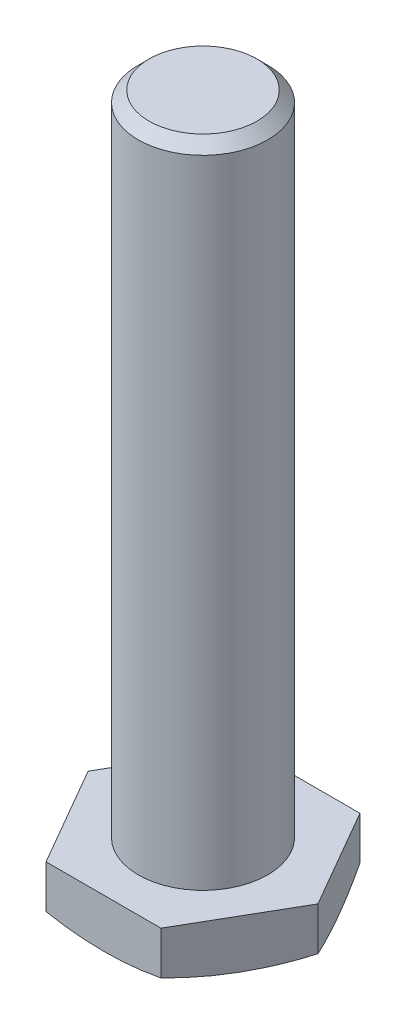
ISO-10303-21;
HEADER;
FILE_DESCRIPTION(('STEP AP214'),'2;1');
FILE_NAME('part.step','',(''),(''),'','','');
FILE_SCHEMA(('AUTOMOTIVE_DESIGN { 1 0 10303 214 1 1 1 1 }'));
ENDSEC;
DATA;
#1=APPLICATION_CONTEXT('core data for automotive mechanical design processes');
#2=APPLICATION_PROTOCOL_DEFINITION('international standard','automotive_design',2000,#1);
#3=PRODUCT_CONTEXT('',#1,'mechanical');
#4=PRODUCT('Part','Part','',(#3));
#5=PRODUCT_RELATED_PRODUCT_CATEGORY('part','',(#4));
#6=PRODUCT_DEFINITION_FORMATION('','',#4);
#7=PRODUCT_DEFINITION_CONTEXT('part definition',#1,'design');
#8=PRODUCT_DEFINITION('design','',#6,#7);
#9=PRODUCT_DEFINITION_SHAPE('','',#8);
#10=(LENGTH_UNIT() NAMED_UNIT(*) SI_UNIT(.MILLI.,.METRE.));
#11=(NAMED_UNIT(*) PLANE_ANGLE_UNIT() SI_UNIT($,.RADIAN.));
#12=(NAMED_UNIT(*) SI_UNIT($,.STERADIAN.) SOLID_ANGLE_UNIT());
#13=UNCERTAINTY_MEASURE_WITH_UNIT(LENGTH_MEASURE(1.E-05),#10,'distance_accuracy_value','');
#14=(GEOMETRIC_REPRESENTATION_CONTEXT(3) GLOBAL_UNCERTAINTY_ASSIGNED_CONTEXT((#13)) GLOBAL_UNIT_ASSIGNED_CONTEXT((#10,
#11,#12)) REPRESENTATION_CONTEXT('',''));
#15=CARTESIAN_POINT('',(0.,0.,0.));
#16=DIRECTION('',(0.,0.,1.));
#17=DIRECTION('',(1.,0.,0.));
#18=AXIS2_PLACEMENT_3D('',#15,#16,#17);
#19=CARTESIAN_POINT('',(0.,17.,0.));
#20=DIRECTION('',(0.,-1.,0.));
#21=DIRECTION('',(0.,0.,-1.));
#22=AXIS2_PLACEMENT_3D('',#19,#20,#21);
#23=PLANE('',#22);
#24=CARTESIAN_POINT('',(0.,17.,0.));
#25=DIRECTION('',(0.,1.,0.));
#26=DIRECTION('',(0.,0.,1.));
#27=AXIS2_PLACEMENT_3D('',#24,#25,#26);
#28=CIRCLE('',#27,2.5);
#29=CARTESIAN_POINT('',(0.,17.,2.5));
#30=VERTEX_POINT('',#29);
#31=EDGE_CURVE('E19',#30,#30,#28,.F.);
#32=ORIENTED_EDGE('',*,*,#31,.T.);
#33=EDGE_LOOP('',(#32));
#34=FACE_BOUND('',#33,.T.);
#35=ADVANCED_FACE('F16',(#34),#23,.T.);
#36=CARTESIAN_POINT('',(0.,0.,0.));
#37=DIRECTION('',(0.,1.,0.));
#38=DIRECTION('',(0.,0.,1.));
#39=AXIS2_PLACEMENT_3D('',#36,#37,#38);
#40=CYLINDRICAL_SURFACE('',#39,2.5);
#41=ORIENTED_EDGE('',*,*,#31,.F.);
#42=EDGE_LOOP('',(#41));
#43=FACE_BOUND('',#42,.T.);
#44=CARTESIAN_POINT('',(0.,0.106646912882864,0.));
#45=DIRECTION('',(0.,1.,0.));
#46=DIRECTION('',(0.,0.,1.));
#47=AXIS2_PLACEMENT_3D('',#44,#45,#46);
#48=CIRCLE('',#47,2.5);
#49=CARTESIAN_POINT('',(0.,0.106646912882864,2.5));
#50=VERTEX_POINT('',#49);
#51=EDGE_CURVE('E77',#50,#50,#48,.T.);
#52=ORIENTED_EDGE('',*,*,#51,.F.);
#53=EDGE_LOOP('',(#52));
#54=FACE_BOUND('',#53,.T.);
#55=ADVANCED_FACE('F105',(#43,#54),#40,.F.);
#56=CARTESIAN_POINT('',(0.,29.3556249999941,0.));
#57=DIRECTION('',(1.,0.,0.));
#58=DIRECTION('',(0.,1.,0.));
#59=AXIS2_PLACEMENT_3D('',#56,#57,#58);
#60=SPHERICAL_SURFACE('',#59,29.3556249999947);
#61=CARTESIAN_POINT('',(-5.32499999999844,1.99999999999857,9.22317055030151));
#62=CARTESIAN_POINT('',(-5.47246201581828,1.94258873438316,8.96775884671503));
#63=CARTESIAN_POINT('',(-5.62038848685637,1.88995042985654,8.71154268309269));
#64=CARTESIAN_POINT('',(-5.91625845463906,1.7945109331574,8.19908086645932));
#65=CARTESIAN_POINT('',(-6.06419801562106,1.75166093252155,7.94284203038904));
#66=CARTESIAN_POINT('',(-6.36008656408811,1.67565778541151,7.4303480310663));
#67=CARTESIAN_POINT('',(-6.50803306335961,1.64246588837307,7.17409717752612));
#68=CARTESIAN_POINT('',(-6.80392949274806,1.58566682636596,6.66158952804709));
#69=CARTESIAN_POINT('',(-6.95187803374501,1.56203071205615,6.4053351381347));
#70=CARTESIAN_POINT('',(-7.24777435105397,1.52426139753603,5.89282768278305));
#71=CARTESIAN_POINT('',(-7.39572151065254,1.51010886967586,5.63657568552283));
#72=CARTESIAN_POINT('',(-7.69161255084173,1.49125355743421,5.12407737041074));
#73=CARTESIAN_POINT('',(-7.83955627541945,1.48654097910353,4.86783132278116));
#74=CARTESIAN_POINT('',(-8.13544372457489,1.4865409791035,4.35533922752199));
#75=CARTESIAN_POINT('',(-8.2833874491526,1.49125355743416,4.09909317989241));
#76=CARTESIAN_POINT('',(-8.5792784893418,1.51010886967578,3.58659486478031));
#77=CARTESIAN_POINT('',(-8.72722564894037,1.52426139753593,3.33034286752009));
#78=CARTESIAN_POINT('',(-9.02312196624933,1.56203071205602,2.81783541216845));
#79=CARTESIAN_POINT('',(-9.17107050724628,1.5856668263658,2.56158102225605));
#80=CARTESIAN_POINT('',(-9.46696693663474,1.64246588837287,2.04907337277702));
#81=CARTESIAN_POINT('',(-9.61491343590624,1.6756577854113,1.79282251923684));
#82=CARTESIAN_POINT('',(-9.91080198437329,1.7516609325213,1.2803285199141));
#83=CARTESIAN_POINT('',(-10.0587415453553,1.79451093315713,1.02408968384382));
#84=CARTESIAN_POINT('',(-10.354611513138,1.88995042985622,0.511627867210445));
#85=CARTESIAN_POINT('',(-10.5025379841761,1.94258873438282,0.255411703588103));
#86=CARTESIAN_POINT('',(-10.6499999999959,1.9999999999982,1.61864535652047E-12));
#87=B_SPLINE_CURVE_WITH_KNOTS('',3,(#61,#62,#63,#64,#65,#66,#67,#68,#69,#70,#71,#72,#73,#74,#75,
#76,#77,#78,#79,#80,#81,#82,#83,#84,#85,#86),.UNSPECIFIED.,.F.,.F.,(4,2,2,2,2,2,2,2,2,2,2,2,4),
(0.,0.901340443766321,1.79808324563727,2.69117686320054,3.58154419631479,4.47009138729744,
5.35771623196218,6.24534107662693,7.13388826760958,8.02425560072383,8.91734921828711,
9.81409202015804,10.7154324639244),.UNSPECIFIED.);
#88=CARTESIAN_POINT('',(-5.32499999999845,1.99999999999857,9.22317055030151));
#89=VERTEX_POINT('',#88);
#90=CARTESIAN_POINT('',(-10.6499999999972,1.99999999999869,2.12921901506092E-12));
#91=VERTEX_POINT('',#90);
#92=EDGE_CURVE('E80',#89,#91,#87,.T.);
#93=ORIENTED_EDGE('',*,*,#92,.T.);
#94=CARTESIAN_POINT('',(-10.6499999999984,1.99999999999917,2.63849163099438E-12));
#95=CARTESIAN_POINT('',(-10.5025379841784,1.94258873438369,-0.255411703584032));
#96=CARTESIAN_POINT('',(-10.3546115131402,1.889950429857,-0.511627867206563));
#97=CARTESIAN_POINT('',(-10.0587415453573,1.79451093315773,-1.02408968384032));
#98=CARTESIAN_POINT('',(-9.9108019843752,1.75166093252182,-1.28032851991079));
#99=CARTESIAN_POINT('',(-9.61491343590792,1.67565778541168,-1.79282251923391));
#100=CARTESIAN_POINT('',(-9.46696693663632,1.6424658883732,-2.04907337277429));
#101=CARTESIAN_POINT('',(-9.17107050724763,1.58566682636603,-2.5615810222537));
#102=CARTESIAN_POINT('',(-9.02312196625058,1.5620307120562,-2.81783541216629));
#103=CARTESIAN_POINT('',(-8.72722564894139,1.52426139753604,-3.33034286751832));
#104=CARTESIAN_POINT('',(-8.57927848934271,1.51010886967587,-3.58659486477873));
#105=CARTESIAN_POINT('',(-8.28338744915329,1.49125355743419,-4.09909317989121));
#106=CARTESIAN_POINT('',(-8.13544372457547,1.48654097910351,-4.35533922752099));
#107=CARTESIAN_POINT('',(-7.83955627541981,1.4865409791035,-4.86783132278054));
#108=CARTESIAN_POINT('',(-7.69161255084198,1.49125355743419,-5.12407737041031));
#109=CARTESIAN_POINT('',(-7.39572151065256,1.51010886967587,-5.63657568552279));
#110=CARTESIAN_POINT('',(-7.24777435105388,1.52426139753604,-5.89282768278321));
#111=CARTESIAN_POINT('',(-6.9518780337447,1.5620307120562,-6.40533513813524));
#112=CARTESIAN_POINT('',(-6.80392949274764,1.58566682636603,-6.66158952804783));
#113=CARTESIAN_POINT('',(-6.50803306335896,1.6424658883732,-7.17409717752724));
#114=CARTESIAN_POINT('',(-6.36008656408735,1.67565778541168,-7.43034803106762));
#115=CARTESIAN_POINT('',(-6.06419801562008,1.75166093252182,-7.94284203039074));
#116=CARTESIAN_POINT('',(-5.91625845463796,1.79451093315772,-8.19908086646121));
#117=CARTESIAN_POINT('',(-5.62038848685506,1.88995042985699,-8.71154268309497));
#118=CARTESIAN_POINT('',(-5.47246201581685,1.94258873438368,-8.96775884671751));
#119=CARTESIAN_POINT('',(-5.32499999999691,1.99999999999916,-9.22317055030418));
#120=B_SPLINE_CURVE_WITH_KNOTS('',3,(#94,#95,#96,#97,#98,#99,#100,#101,#102,#103,#104,#105,#106,
#107,#108,#109,#110,#111,#112,#113,#114,#115,#116,#117,#118,#119),.UNSPECIFIED.,.F.,.F.,(4,2,2,
2,2,2,2,2,2,2,2,2,4),(0.,0.901340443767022,1.79808324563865,2.69117686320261,3.58154419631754,
4.47009138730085,5.35771623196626,6.24534107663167,7.13388826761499,8.02425560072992,
8.91734921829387,9.8140920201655,10.7154324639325),.UNSPECIFIED.);
#121=CARTESIAN_POINT('',(-5.32499999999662,1.99999999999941,-9.22317055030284));
#122=VERTEX_POINT('',#121);
#123=EDGE_CURVE('E65',#91,#122,#120,.T.);
#124=ORIENTED_EDGE('',*,*,#123,.T.);
#125=CARTESIAN_POINT('',(-5.32499999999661,1.9999999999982,-9.22317055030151));
#126=CARTESIAN_POINT('',(-5.03007596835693,1.94258873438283,-9.22317055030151));
#127=CARTESIAN_POINT('',(-4.73422302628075,1.88995042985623,-9.22317055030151));
#128=CARTESIAN_POINT('',(-4.14248309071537,1.79451093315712,-9.22317055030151));
#129=CARTESIAN_POINT('',(-3.84660396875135,1.75166093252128,-9.22317055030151));
#130=CARTESIAN_POINT('',(-3.25482687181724,1.67565778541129,-9.22317055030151));
#131=CARTESIAN_POINT('',(-2.95893387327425,1.64246588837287,-9.22317055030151));
#132=CARTESIAN_POINT('',(-2.36714101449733,1.5856668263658,-9.22317055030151));
#133=CARTESIAN_POINT('',(-2.07124393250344,1.562030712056,-9.22317055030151));
#134=CARTESIAN_POINT('',(-1.47945129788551,1.52426139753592,-9.22317055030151));
#135=CARTESIAN_POINT('',(-1.18355697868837,1.51010886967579,-9.22317055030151));
#136=CARTESIAN_POINT('',(-0.591774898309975,1.49125355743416,-9.22317055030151));
#137=CARTESIAN_POINT('',(-0.29588744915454,1.48654097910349,-9.22317055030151));
#138=CARTESIAN_POINT('',(0.295887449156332,1.4865409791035,-9.22317055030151));
#139=CARTESIAN_POINT('',(0.591774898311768,1.49125355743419,-9.22317055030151));
#140=CARTESIAN_POINT('',(1.18355697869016,1.51010886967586,-9.22317055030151));
#141=CARTESIAN_POINT('',(1.4794512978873,1.52426139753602,-9.22317055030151));
#142=CARTESIAN_POINT('',(2.07124393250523,1.56203071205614,-9.22317055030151));
#143=CARTESIAN_POINT('',(2.36714101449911,1.58566682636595,-9.22317055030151));
#144=CARTESIAN_POINT('',(2.95893387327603,1.64246588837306,-9.22317055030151));
#145=CARTESIAN_POINT('',(3.25482687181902,1.6756577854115,-9.22317055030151));
#146=CARTESIAN_POINT('',(3.84660396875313,1.75166093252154,-9.22317055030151));
#147=CARTESIAN_POINT('',(4.14248309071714,1.79451093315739,-9.22317055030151));
#148=CARTESIAN_POINT('',(4.73422302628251,1.88995042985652,-9.22317055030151));
#149=CARTESIAN_POINT('',(5.0300759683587,1.94258873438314,-9.22317055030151));
#150=CARTESIAN_POINT('',(5.32499999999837,1.99999999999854,-9.2231705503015));
#151=B_SPLINE_CURVE_WITH_KNOTS('',3,(#125,#126,#127,#128,#129,#130,#131,#132,#133,#134,#135,
#136,#137,#138,#139,#140,#141,#142,#143,#144,#145,#146,#147,#148,#149,#150),.UNSPECIFIED.,.F.,
.F.,(4,2,2,2,2,2,2,2,2,2,2,2,4),(0.,0.901340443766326,1.79808324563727,2.69117686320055,
3.58154419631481,4.47009138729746,5.3577162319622,6.24534107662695,7.1338882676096,
8.02425560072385,8.91734921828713,9.81409202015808,10.7154324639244),.UNSPECIFIED.);
#152=CARTESIAN_POINT('',(5.32499999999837,1.99999999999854,-9.22317055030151));
#153=VERTEX_POINT('',#152);
#154=EDGE_CURVE('E116',#122,#153,#151,.T.);
#155=ORIENTED_EDGE('',*,*,#154,.T.);
#156=CARTESIAN_POINT('',(5.32499999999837,1.99999999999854,-9.22317055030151));
#157=CARTESIAN_POINT('',(5.47246201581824,1.94258873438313,-8.96775884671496));
#158=CARTESIAN_POINT('',(5.62038848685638,1.8899504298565,-8.71154268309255));
#159=CARTESIAN_POINT('',(5.91625845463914,1.79451093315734,-8.19908086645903));
#160=CARTESIAN_POINT('',(6.06419801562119,1.75166093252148,-7.94284203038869));
#161=CARTESIAN_POINT('',(6.36008656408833,1.67565778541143,-7.43034803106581));
#162=CARTESIAN_POINT('',(6.50803306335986,1.64246588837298,-7.17409717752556));
#163=CARTESIAN_POINT('',(6.8039294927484,1.58566682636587,-6.66158952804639));
#164=CARTESIAN_POINT('',(6.95187803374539,1.56203071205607,-6.40533513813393));
#165=CARTESIAN_POINT('',(7.24777435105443,1.52426139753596,-5.89282768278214));
#166=CARTESIAN_POINT('',(7.39572151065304,1.51010886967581,-5.63657568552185));
#167=CARTESIAN_POINT('',(7.69161255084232,1.49125355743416,-5.12407737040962));
#168=CARTESIAN_POINT('',(7.83955627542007,1.48654097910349,-4.86783132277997));
#169=CARTESIAN_POINT('',(8.13544372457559,1.48654097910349,-4.35533922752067));
#170=CARTESIAN_POINT('',(8.28338744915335,1.49125355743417,-4.09909317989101));
#171=CARTESIAN_POINT('',(8.57927848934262,1.51010886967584,-3.58659486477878));
#172=CARTESIAN_POINT('',(8.72722564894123,1.52426139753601,-3.33034286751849));
#173=CARTESIAN_POINT('',(9.02312196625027,1.56203071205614,-2.81783541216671));
#174=CARTESIAN_POINT('',(9.17107050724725,1.58566682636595,-2.56158102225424));
#175=CARTESIAN_POINT('',(9.46696693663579,1.64246588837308,-2.04907337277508));
#176=CARTESIAN_POINT('',(9.61491343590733,1.67565778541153,-1.79282251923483));
#177=CARTESIAN_POINT('',(9.91080198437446,1.7516609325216,-1.28032851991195));
#178=CARTESIAN_POINT('',(10.0587415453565,1.79451093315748,-1.02408968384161));
#179=CARTESIAN_POINT('',(10.3546115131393,1.88995042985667,-0.511627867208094));
#180=CARTESIAN_POINT('',(10.5025379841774,1.94258873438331,-0.255411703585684));
#181=CARTESIAN_POINT('',(10.6499999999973,1.99999999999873,8.66749449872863E-13));
#182=B_SPLINE_CURVE_WITH_KNOTS('',3,(#156,#157,#158,#159,#160,#161,#162,#163,#164,#165,#166,
#167,#168,#169,#170,#171,#172,#173,#174,#175,#176,#177,#178,#179,#180,#181),.UNSPECIFIED.,.F.,
.F.,(4,2,2,2,2,2,2,2,2,2,2,2,4),(0.,0.901340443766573,1.79808324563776,2.69117686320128,
3.58154419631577,4.47009138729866,5.35771623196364,6.24534107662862,7.13388826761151,
8.02425560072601,8.91734921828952,9.81409202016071,10.7154324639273),.UNSPECIFIED.);
#183=CARTESIAN_POINT('',(10.6499999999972,1.9999999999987,1.36945666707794E-13));
#184=VERTEX_POINT('',#183);
#185=EDGE_CURVE('E124',#153,#184,#182,.T.);
#186=ORIENTED_EDGE('',*,*,#185,.T.);
#187=CARTESIAN_POINT('',(10.6499999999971,1.99999999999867,-5.92424435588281E-13));
#188=CARTESIAN_POINT('',(10.5025379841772,1.94258873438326,0.25541170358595));
#189=CARTESIAN_POINT('',(10.3546115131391,1.88995042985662,0.511627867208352));
#190=CARTESIAN_POINT('',(10.0587415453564,1.79451093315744,1.02408968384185));
#191=CARTESIAN_POINT('',(9.91080198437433,1.75166093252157,1.28032851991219));
#192=CARTESIAN_POINT('',(9.61491343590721,1.67565778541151,1.79282251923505));
#193=CARTESIAN_POINT('',(9.46696693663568,1.64246588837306,2.04907337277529));
#194=CARTESIAN_POINT('',(9.17107050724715,1.58566682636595,2.56158102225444));
#195=CARTESIAN_POINT('',(9.02312196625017,1.56203071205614,2.8178354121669));
#196=CARTESIAN_POINT('',(8.72722564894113,1.52426139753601,3.33034286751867));
#197=CARTESIAN_POINT('',(8.57927848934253,1.51010886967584,3.58659486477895));
#198=CARTESIAN_POINT('',(8.28338744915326,1.49125355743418,4.09909317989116));
#199=CARTESIAN_POINT('',(8.13544372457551,1.4865409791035,4.35533922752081));
#200=CARTESIAN_POINT('',(7.83955627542,1.48654097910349,4.8678313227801));
#201=CARTESIAN_POINT('',(7.69161255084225,1.49125355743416,5.12407737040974));
#202=CARTESIAN_POINT('',(7.39572151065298,1.51010886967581,5.63657568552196));
#203=CARTESIAN_POINT('',(7.24777435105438,1.52426139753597,5.89282768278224));
#204=CARTESIAN_POINT('',(6.95187803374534,1.56203071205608,6.40533513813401));
#205=CARTESIAN_POINT('',(6.80392949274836,1.58566682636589,6.66158952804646));
#206=CARTESIAN_POINT('',(6.50803306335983,1.64246588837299,7.17409717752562));
#207=CARTESIAN_POINT('',(6.3600865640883,1.67565778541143,7.43034803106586));
#208=CARTESIAN_POINT('',(6.06419801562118,1.75166093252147,7.94284203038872));
#209=CARTESIAN_POINT('',(5.91625845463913,1.79451093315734,8.19908086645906));
#210=CARTESIAN_POINT('',(5.62038848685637,1.8899504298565,8.71154268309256));
#211=CARTESIAN_POINT('',(5.47246201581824,1.94258873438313,8.96775884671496));
#212=CARTESIAN_POINT('',(5.32499999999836,1.99999999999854,9.2231705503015));
#213=B_SPLINE_CURVE_WITH_KNOTS('',3,(#187,#188,#189,#190,#191,#192,#193,#194,#195,#196,#197,
#198,#199,#200,#201,#202,#203,#204,#205,#206,#207,#208,#209,#210,#211,#212),.UNSPECIFIED.,.F.,
.F.,(4,2,2,2,2,2,2,2,2,2,2,2,4),(0.,0.901340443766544,1.79808324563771,2.6911768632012,
3.58154419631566,4.47009138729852,5.35771623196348,6.24534107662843,7.13388826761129,
8.02425560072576,8.91734921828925,9.81409202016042,10.715432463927),.UNSPECIFIED.);
#214=CARTESIAN_POINT('',(5.32499999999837,1.99999999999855,9.22317055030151));
#215=VERTEX_POINT('',#214);
#216=EDGE_CURVE('E130',#184,#215,#213,.T.);
#217=ORIENTED_EDGE('',*,*,#216,.T.);
#218=CARTESIAN_POINT('',(5.32499999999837,1.99999999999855,9.22317055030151));
#219=CARTESIAN_POINT('',(5.03007596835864,1.94258873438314,9.22317055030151));
#220=CARTESIAN_POINT('',(4.73422302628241,1.88995042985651,9.22317055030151));
#221=CARTESIAN_POINT('',(4.14248309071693,1.79451093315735,9.22317055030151));
#222=CARTESIAN_POINT('',(3.84660396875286,1.75166093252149,9.22317055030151));
#223=CARTESIAN_POINT('',(3.25482687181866,1.67565778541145,9.22317055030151));
#224=CARTESIAN_POINT('',(2.95893387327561,1.64246588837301,9.22317055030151));
#225=CARTESIAN_POINT('',(2.36714101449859,1.58566682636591,9.22317055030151));
#226=CARTESIAN_POINT('',(2.07124393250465,1.5620307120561,9.22317055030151));
#227=CARTESIAN_POINT('',(1.47945129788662,1.52426139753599,9.22317055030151));
#228=CARTESIAN_POINT('',(1.18355697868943,1.51010886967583,9.22317055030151));
#229=CARTESIAN_POINT('',(0.591774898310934,1.49125355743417,9.22317055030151));
#230=CARTESIAN_POINT('',(0.295887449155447,1.4865409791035,9.22317055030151));
#231=CARTESIAN_POINT('',(-0.295887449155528,1.4865409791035,9.22317055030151));
#232=CARTESIAN_POINT('',(-0.591774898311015,1.49125355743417,9.22317055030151));
#233=CARTESIAN_POINT('',(-1.18355697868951,1.51010886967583,9.22317055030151));
#234=CARTESIAN_POINT('',(-1.4794512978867,1.52426139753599,9.22317055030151));
#235=CARTESIAN_POINT('',(-2.07124393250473,1.56203071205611,9.22317055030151));
#236=CARTESIAN_POINT('',(-2.36714101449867,1.58566682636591,9.22317055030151));
#237=CARTESIAN_POINT('',(-2.95893387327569,1.64246588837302,9.22317055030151));
#238=CARTESIAN_POINT('',(-3.25482687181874,1.67565778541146,9.22317055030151));
#239=CARTESIAN_POINT('',(-3.84660396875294,1.75166093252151,9.22317055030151));
#240=CARTESIAN_POINT('',(-4.14248309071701,1.79451093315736,9.22317055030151));
#241=CARTESIAN_POINT('',(-4.73422302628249,1.88995042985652,9.22317055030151));
#242=CARTESIAN_POINT('',(-5.03007596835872,1.94258873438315,9.22317055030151));
#243=CARTESIAN_POINT('',(-5.32499999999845,1.99999999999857,9.2231705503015));
#244=B_SPLINE_CURVE_WITH_KNOTS('',3,(#218,#219,#220,#221,#222,#223,#224,#225,#226,#227,#228,
#229,#230,#231,#232,#233,#234,#235,#236,#237,#238,#239,#240,#241,#242,#243),.UNSPECIFIED.,.F.,
.F.,(4,2,2,2,2,2,2,2,2,2,2,2,4),(0.,0.901340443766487,1.79808324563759,2.69117686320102,
3.58154419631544,4.47009138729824,5.35771623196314,6.24534107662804,7.13388826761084,
8.02425560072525,8.91734921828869,9.81409202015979,10.7154324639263),.UNSPECIFIED.);
#245=EDGE_CURVE('E84',#215,#89,#244,.T.);
#246=ORIENTED_EDGE('',*,*,#245,.T.);
#247=EDGE_LOOP('',(#93,#124,#155,#186,#217,#246));
#248=FACE_BOUND('',#247,.T.);
#249=ORIENTED_EDGE('',*,*,#51,.T.);
#250=EDGE_LOOP('',(#249));
#251=FACE_BOUND('',#250,.T.);
#252=ADVANCED_FACE('F81',(#248,#251),#60,.T.);
#253=CARTESIAN_POINT('',(-10.6499999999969,5.99999999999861,0.));
#254=DIRECTION('',(0.866025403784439,0.,0.5));
#255=DIRECTION('',(0.5,0.,-0.866025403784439));
#256=AXIS2_PLACEMENT_3D('',#253,#254,#255);
#257=PLANE('',#256);
#258=DIRECTION('',(0.,1.,0.));
#259=VECTOR('',#258,1.);
#260=CARTESIAN_POINT('',(-10.6499999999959,5.99999999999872,1.87697080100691E-12));
#261=LINE('',#260,#259);
#262=CARTESIAN_POINT('',(-10.6499999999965,5.99999999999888,8.61770448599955E-13));
#263=VERTEX_POINT('',#262);
#264=EDGE_CURVE('E70',#91,#263,#261,.T.);
#265=ORIENTED_EDGE('',*,*,#264,.T.);
#266=DIRECTION('',(-0.5,0.,0.866025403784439));
#267=VECTOR('',#266,1.);
#268=CARTESIAN_POINT('',(-5.32499999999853,5.99999999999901,-9.22317055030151));
#269=LINE('',#268,#267);
#270=CARTESIAN_POINT('',(-5.32499999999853,5.99999999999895,-9.22317055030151));
#271=VERTEX_POINT('',#270);
#272=EDGE_CURVE('E99',#271,#263,#269,.T.);
#273=ORIENTED_EDGE('',*,*,#272,.F.);
#274=DIRECTION('',(0.,1.,0.));
#275=VECTOR('',#274,1.);
#276=CARTESIAN_POINT('',(-5.32499999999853,5.99999999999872,-9.22317055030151));
#277=LINE('',#276,#275);
#278=EDGE_CURVE('E73',#271,#122,#277,.F.);
#279=ORIENTED_EDGE('',*,*,#278,.T.);
#280=ORIENTED_EDGE('',*,*,#123,.F.);
#281=EDGE_LOOP('',(#265,#273,#279,#280));
#282=FACE_BOUND('',#281,.T.);
#283=ADVANCED_FACE('F67',(#282),#257,.F.);
#284=CARTESIAN_POINT('',(-5.32499999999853,5.99999999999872,9.22317055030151));
#285=DIRECTION('',(0.866025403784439,0.,-0.5));
#286=DIRECTION('',(-0.5,0.,-0.866025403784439));
#287=AXIS2_PLACEMENT_3D('',#284,#285,#286);
#288=PLANE('',#287);
#289=DIRECTION('',(0.,1.,0.));
#290=VECTOR('',#289,1.);
#291=CARTESIAN_POINT('',(-5.32499999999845,5.99999999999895,9.22317055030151));
#292=LINE('',#291,#290);
#293=CARTESIAN_POINT('',(-5.32499999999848,5.99999999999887,9.22317055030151));
#294=VERTEX_POINT('',#293);
#295=EDGE_CURVE('E87',#89,#294,#292,.T.);
#296=ORIENTED_EDGE('',*,*,#295,.T.);
#297=DIRECTION('',(0.5,0.,0.866025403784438));
#298=VECTOR('',#297,1.);
#299=CARTESIAN_POINT('',(-10.6499999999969,5.99999999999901,0.));
#300=LINE('',#299,#298);
#301=EDGE_CURVE('E91',#263,#294,#300,.T.);
#302=ORIENTED_EDGE('',*,*,#301,.F.);
#303=ORIENTED_EDGE('',*,*,#264,.F.);
#304=ORIENTED_EDGE('',*,*,#92,.F.);
#305=EDGE_LOOP('',(#296,#302,#303,#304));
#306=FACE_BOUND('',#305,.T.);
#307=ADVANCED_FACE('F89',(#306),#288,.F.);
#308=CARTESIAN_POINT('',(5.32499999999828,5.99999999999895,9.22317055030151));
#309=DIRECTION('',(0.,0.,-1.));
#310=DIRECTION('',(-1.,0.,0.));
#311=AXIS2_PLACEMENT_3D('',#308,#309,#310);
#312=PLANE('',#311);
#313=DIRECTION('',(0.,1.,0.));
#314=VECTOR('',#313,1.);
#315=CARTESIAN_POINT('',(5.3249999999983,5.99999999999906,9.22317055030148));
#316=LINE('',#315,#314);
#317=CARTESIAN_POINT('',(5.3249999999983,5.99999999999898,9.22317055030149));
#318=VERTEX_POINT('',#317);
#319=EDGE_CURVE('E140',#215,#318,#316,.T.);
#320=ORIENTED_EDGE('',*,*,#319,.T.);
#321=DIRECTION('',(1.,0.,0.));
#322=VECTOR('',#321,1.);
#323=CARTESIAN_POINT('',(8.32499999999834,5.99999999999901,9.22317055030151));
#324=LINE('',#323,#322);
#325=EDGE_CURVE('E204',#294,#318,#324,.T.);
#326=ORIENTED_EDGE('',*,*,#325,.F.);
#327=ORIENTED_EDGE('',*,*,#295,.F.);
#328=ORIENTED_EDGE('',*,*,#245,.F.);
#329=EDGE_LOOP('',(#320,#326,#327,#328));
#330=FACE_BOUND('',#329,.T.);
#331=ADVANCED_FACE('F144',(#330),#312,.F.);
#332=CARTESIAN_POINT('',(10.6499999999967,5.99999999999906,0.));
#333=DIRECTION('',(-0.866025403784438,0.,-0.5));
#334=DIRECTION('',(-0.5,0.,0.866025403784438));
#335=AXIS2_PLACEMENT_3D('',#332,#333,#334);
#336=PLANE('',#335);
#337=DIRECTION('',(0.,1.,0.));
#338=VECTOR('',#337,1.);
#339=CARTESIAN_POINT('',(10.6499999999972,5.99999999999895,9.59302082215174E-13));
#340=LINE('',#339,#338);
#341=CARTESIAN_POINT('',(10.649999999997,5.99999999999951,6.01677593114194E-13));
#342=VERTEX_POINT('',#341);
#343=EDGE_CURVE('E190',#184,#342,#340,.T.);
#344=ORIENTED_EDGE('',*,*,#343,.T.);
#345=DIRECTION('',(0.5,0.,-0.866025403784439));
#346=VECTOR('',#345,1.);
#347=CARTESIAN_POINT('',(5.32499999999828,5.99999999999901,9.22317055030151));
#348=LINE('',#347,#346);
#349=EDGE_CURVE('E193',#318,#342,#348,.T.);
#350=ORIENTED_EDGE('',*,*,#349,.F.);
#351=ORIENTED_EDGE('',*,*,#319,.F.);
#352=ORIENTED_EDGE('',*,*,#216,.F.);
#353=EDGE_LOOP('',(#344,#350,#351,#352));
#354=FACE_BOUND('',#353,.T.);
#355=ADVANCED_FACE('F147',(#354),#336,.F.);
#356=CARTESIAN_POINT('',(5.32499999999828,5.99999999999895,-9.22317055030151));
#357=DIRECTION('',(-0.866025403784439,0.,0.5));
#358=DIRECTION('',(0.5,0.,0.866025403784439));
#359=AXIS2_PLACEMENT_3D('',#356,#357,#358);
#360=PLANE('',#359);
#361=DIRECTION('',(0.,1.,0.));
#362=VECTOR('',#361,1.);
#363=CARTESIAN_POINT('',(5.32499999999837,5.99999999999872,-9.22317055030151));
#364=LINE('',#363,#362);
#365=CARTESIAN_POINT('',(5.32499999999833,5.99999999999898,-9.22317055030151));
#366=VERTEX_POINT('',#365);
#367=EDGE_CURVE('E34',#153,#366,#364,.T.);
#368=ORIENTED_EDGE('',*,*,#367,.T.);
#369=DIRECTION('',(-0.5,0.,-0.866025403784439));
#370=VECTOR('',#369,1.);
#371=CARTESIAN_POINT('',(10.6499999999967,5.99999999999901,0.));
#372=LINE('',#371,#370);
#373=EDGE_CURVE('E198',#342,#366,#372,.T.);
#374=ORIENTED_EDGE('',*,*,#373,.F.);
#375=ORIENTED_EDGE('',*,*,#343,.F.);
#376=ORIENTED_EDGE('',*,*,#185,.F.);
#377=EDGE_LOOP('',(#368,#374,#375,#376));
#378=FACE_BOUND('',#377,.T.);
#379=ADVANCED_FACE('F178',(#378),#360,.F.);
#380=CARTESIAN_POINT('',(-5.32499999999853,5.99999999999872,-9.22317055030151));
#381=DIRECTION('',(0.,0.,1.));
#382=DIRECTION('',(1.,0.,0.));
#383=AXIS2_PLACEMENT_3D('',#380,#381,#382);
#384=PLANE('',#383);
#385=ORIENTED_EDGE('',*,*,#278,.F.);
#386=DIRECTION('',(1.,0.,0.));
#387=VECTOR('',#386,1.);
#388=CARTESIAN_POINT('',(8.32499999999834,5.99999999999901,-9.22317055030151));
#389=LINE('',#388,#387);
#390=EDGE_CURVE('E201',#366,#271,#389,.F.);
#391=ORIENTED_EDGE('',*,*,#390,.F.);
#392=ORIENTED_EDGE('',*,*,#367,.F.);
#393=ORIENTED_EDGE('',*,*,#154,.F.);
#394=EDGE_LOOP('',(#385,#391,#392,#393));
#395=FACE_BOUND('',#394,.T.);
#396=ADVANCED_FACE('F174',(#395),#384,.F.);
#397=CARTESIAN_POINT('',(2.99999999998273,65.9999999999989,0.));
#398=DIRECTION('',(0.,1.,0.));
#399=DIRECTION('',(0.,0.,1.));
#400=AXIS2_PLACEMENT_3D('',#397,#398,#399);
#401=PLANE('',#400);
#402=CARTESIAN_POINT('',(-1.38300829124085E-12,66.0000000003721,0.));
#403=DIRECTION('',(0.,-1.,0.));
#404=DIRECTION('',(1.,0.,0.));
#405=AXIS2_PLACEMENT_3D('',#402,#403,#404);
#406=CIRCLE('',#405,5.00000000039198);
#407=CARTESIAN_POINT('',(5.0000000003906,66.0000000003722,0.));
#408=VERTEX_POINT('',#407);
#409=EDGE_CURVE('E210',#408,#408,#406,.T.);
#410=ORIENTED_EDGE('',*,*,#409,.F.);
#411=EDGE_LOOP('',(#410));
#412=FACE_BOUND('',#411,.T.);
#413=ADVANCED_FACE('F171',(#412),#401,.T.);
#414=CARTESIAN_POINT('',(8.32499999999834,5.99999999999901,0.));
#415=DIRECTION('',(0.,1.,0.));
#416=DIRECTION('',(0.,0.,1.));
#417=AXIS2_PLACEMENT_3D('',#414,#415,#416);
#418=PLANE('',#417);
#419=CARTESIAN_POINT('',(-1.25758099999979E-13,5.99999999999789,0.));
#420=DIRECTION('',(0.,-1.,0.));
#421=DIRECTION('',(1.,0.,0.));
#422=AXIS2_PLACEMENT_3D('',#419,#420,#421);
#423=CIRCLE('',#422,5.99999999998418);
#424=CARTESIAN_POINT('',(5.99999999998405,5.99999999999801,0.));
#425=VERTEX_POINT('',#424);
#426=EDGE_CURVE('E25',#425,#425,#423,.F.);
#427=ORIENTED_EDGE('',*,*,#426,.F.);
#428=EDGE_LOOP('',(#427));
#429=FACE_BOUND('',#428,.T.);
#430=ORIENTED_EDGE('',*,*,#373,.T.);
#431=ORIENTED_EDGE('',*,*,#390,.T.);
#432=ORIENTED_EDGE('',*,*,#272,.T.);
#433=ORIENTED_EDGE('',*,*,#301,.T.);
#434=ORIENTED_EDGE('',*,*,#325,.T.);
#435=ORIENTED_EDGE('',*,*,#349,.T.);
#436=EDGE_LOOP('',(#430,#431,#432,#433,#434,#435));
#437=FACE_BOUND('',#436,.T.);
#438=ADVANCED_FACE('F164',(#429,#437),#418,.T.);
#439=CARTESIAN_POINT('',(-1.36219160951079E-12,64.9999999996,0.));
#440=DIRECTION('',(0.,-1.,0.));
#441=DIRECTION('',(1.,0.,0.));
#442=AXIS2_PLACEMENT_3D('',#439,#440,#441);
#443=CONICAL_SURFACE('',#442,5.99999999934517,0.785398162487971);
#444=CARTESIAN_POINT('',(-1.36237804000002E-12,64.9999999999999,0.));
#445=DIRECTION('',(0.,-1.,0.));
#446=DIRECTION('',(1.,0.,0.));
#447=AXIS2_PLACEMENT_3D('',#444,#445,#446);
#448=CIRCLE('',#447,5.99999999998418);
#449=CARTESIAN_POINT('',(5.99999999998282,65.,0.));
#450=VERTEX_POINT('',#449);
#451=EDGE_CURVE('E11',#450,#450,#448,.T.);
#452=ORIENTED_EDGE('',*,*,#451,.F.);
#453=EDGE_LOOP('',(#452));
#454=FACE_BOUND('',#453,.T.);
#455=ORIENTED_EDGE('',*,*,#409,.T.);
#456=EDGE_LOOP('',(#455));
#457=FACE_BOUND('',#456,.T.);
#458=ADVANCED_FACE('F158',(#454,#457),#443,.T.);
#459=CARTESIAN_POINT('',(-7.545479E-13,35.9999999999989,0.));
#460=DIRECTION('',(0.,-1.,0.));
#461=DIRECTION('',(1.,0.,0.));
#462=AXIS2_PLACEMENT_3D('',#459,#460,#461);
#463=CYLINDRICAL_SURFACE('',#462,5.99999999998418);
#464=ORIENTED_EDGE('',*,*,#451,.T.);
#465=EDGE_LOOP('',(#464));
#466=FACE_BOUND('',#465,.T.);
#467=ORIENTED_EDGE('',*,*,#426,.T.);
#468=EDGE_LOOP('',(#467));
#469=FACE_BOUND('',#468,.T.);
#470=ADVANCED_FACE('F156',(#466,#469),#463,.T.);
#471=CLOSED_SHELL('',(#35,#55,#252,#283,#307,#331,#355,#379,#396,#413,#438,#458,#470));
#472=MANIFOLD_SOLID_BREP('B1',#471);
#473=ADVANCED_BREP_SHAPE_REPRESENTATION('',(#18,#472),#14);
#474=SHAPE_DEFINITION_REPRESENTATION(#9,#473);
ENDSEC;
END-ISO-10303-21;
